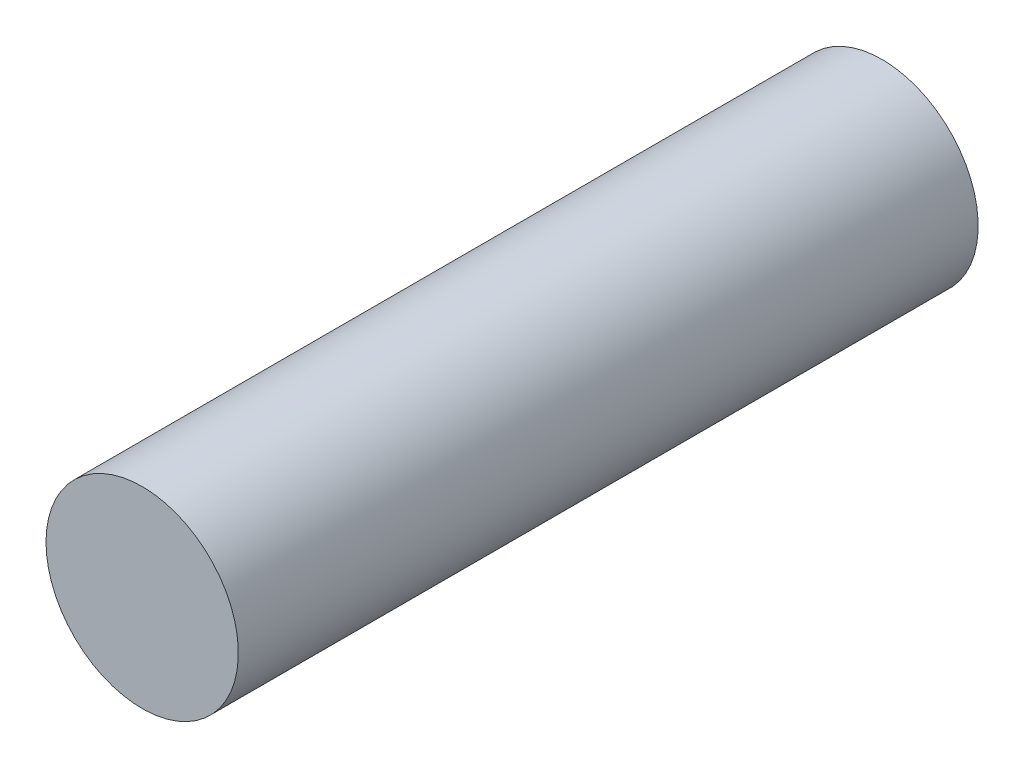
from build123d import *

# Parameters (mm, degrees)
SKETCH1_R          = 1.9812
BASE_EXTRUDE_DEPTH = 15.24


with BuildPart() as part:
    # Sketch1 → Base-Extrude (new body)
    with BuildSketch(Plane.XY):
        with Locations(Location((0, 0, 0), (0, 0, 180))):
            Circle(SKETCH1_R)
    extrude(amount=BASE_EXTRUDE_DEPTH)


solid = part.part
